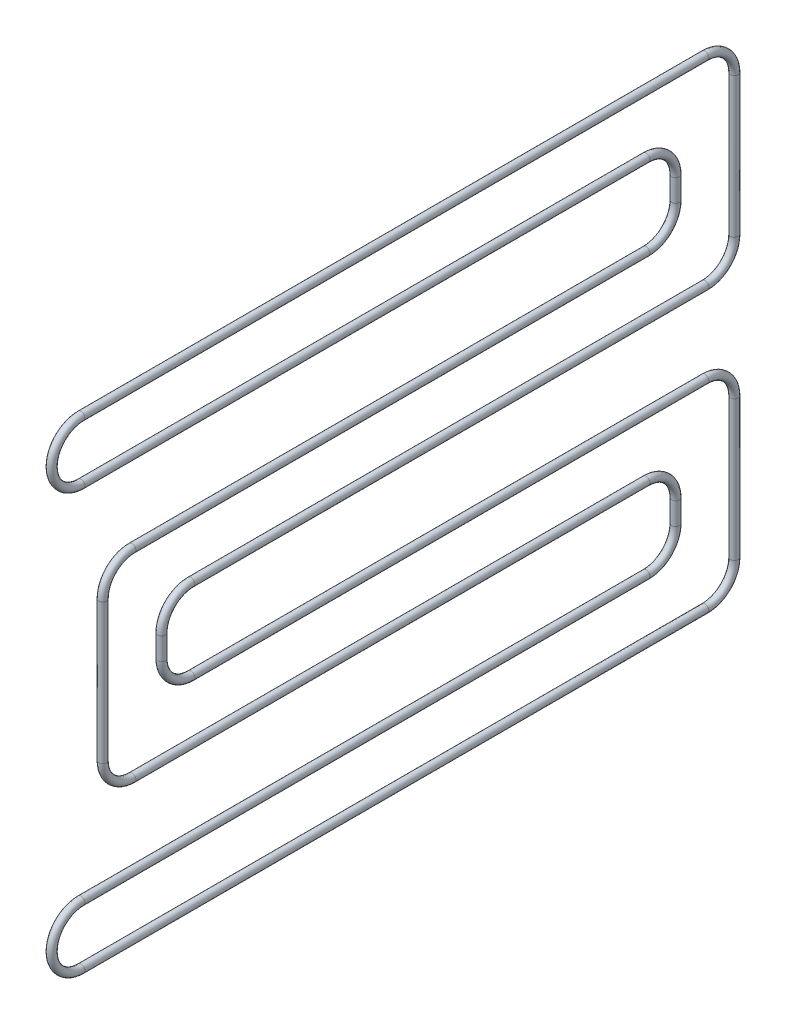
from build123d import *

# Parameters (mm, degrees)
SKIZZE2_R = 2


with BuildPart() as part:
    # Austragung1: sweep along a path in Skizze1
    with BuildLine(Plane(origin=(0, 0, 0), x_dir=(0, 0, -1), z_dir=(1, 0, 0))) as austragung1_path:
        Line((15, -86.3333), (15, -15))
        ThreePointArc((15, -15), (10.606601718, -4.393398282), (0, 0))
        Line((0, 0), (-318, 0))
        ThreePointArc((-318, 0), (-333, -15), (-318, -30))
        Line((-318, -30), (-30, -30))
        ThreePointArc((-30, -30), (-19.393398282, -34.393398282), (-15, -45))
        Line((-15, -45), (-15, -56.3333))
        ThreePointArc((-15, -56.3333), (-19.393398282, -66.939901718), (-30, -71.3333))
        Line((-30, -71.3333), (-292, -71.3333))
        ThreePointArc((-292, -71.3333), (-302.606601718, -75.726698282), (-307, -86.3333))
        Line((-307, -86.3333), (-307, -157.6666))
        ThreePointArc((-307, -157.6666), (-302.606601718, -168.273201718), (-292, -172.6666))
        Line((-292, -172.6666), (-30, -172.6666))
        ThreePointArc((-30, -172.6666), (-19.393398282, -177.059998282), (-15, -187.6666))
        Line((-15, -187.6666), (-15, -198.9999))
        ThreePointArc((-15, -198.9999), (-19.393398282, -209.606501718), (-30, -213.9999))
        Line((-30, -213.9999), (-318, -213.9999))
        ThreePointArc((-318, -213.9999), (-333, -228.9999), (-318, -243.9999))
        Line((-318, -243.9999), (0, -243.9999))
        ThreePointArc((0, -243.9999), (10.606601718, -239.606501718), (15, -228.9999))
        Line((15, -228.9999), (15, -157.6666))
        ThreePointArc((15, -157.6666), (10.606601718, -147.059998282), (0, -142.6666))
        Line((0, -142.6666), (-262, -142.6666))
        ThreePointArc((-262, -142.6666), (-272.606601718, -138.273201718), (-277, -127.6666))
        Line((-277, -127.6666), (-277, -116.3333))
        ThreePointArc((-277, -116.3333), (-272.606601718, -105.726698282), (-262, -101.3333))
        Line((-262, -101.3333), (0, -101.3333))
        ThreePointArc((0, -101.3333), (10.606601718, -96.939901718), (15, -86.3333))
    # Skizze2 → Austragung1 (sweep)
    with BuildSketch(Plane.XY):
        Circle(SKIZZE2_R)
    sweep(path=austragung1_path.line)


solid = part.part
